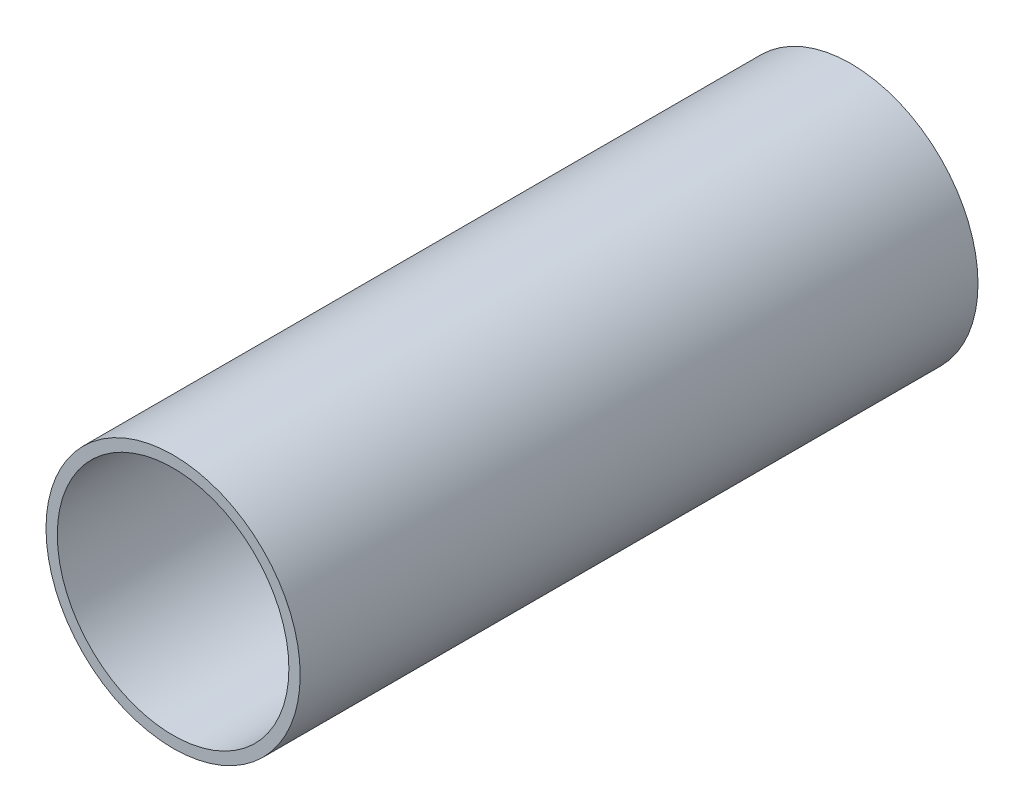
ISO-10303-21;
HEADER;
FILE_DESCRIPTION(('STEP AP214'),'2;1');
FILE_NAME('part.step','',(''),(''),'','','');
FILE_SCHEMA(('AUTOMOTIVE_DESIGN { 1 0 10303 214 1 1 1 1 }'));
ENDSEC;
DATA;
#1=APPLICATION_CONTEXT('core data for automotive mechanical design processes');
#2=APPLICATION_PROTOCOL_DEFINITION('international standard','automotive_design',2000,#1);
#3=PRODUCT_CONTEXT('',#1,'mechanical');
#4=PRODUCT('Part','Part','',(#3));
#5=PRODUCT_RELATED_PRODUCT_CATEGORY('part','',(#4));
#6=PRODUCT_DEFINITION_FORMATION('','',#4);
#7=PRODUCT_DEFINITION_CONTEXT('part definition',#1,'design');
#8=PRODUCT_DEFINITION('design','',#6,#7);
#9=PRODUCT_DEFINITION_SHAPE('','',#8);
#10=(LENGTH_UNIT() NAMED_UNIT(*) SI_UNIT(.MILLI.,.METRE.));
#11=(NAMED_UNIT(*) PLANE_ANGLE_UNIT() SI_UNIT($,.RADIAN.));
#12=(NAMED_UNIT(*) SI_UNIT($,.STERADIAN.) SOLID_ANGLE_UNIT());
#13=UNCERTAINTY_MEASURE_WITH_UNIT(LENGTH_MEASURE(1.E-05),#10,'distance_accuracy_value','');
#14=(GEOMETRIC_REPRESENTATION_CONTEXT(3) GLOBAL_UNCERTAINTY_ASSIGNED_CONTEXT((#13)) GLOBAL_UNIT_ASSIGNED_CONTEXT((#10,
#11,#12)) REPRESENTATION_CONTEXT('',''));
#15=CARTESIAN_POINT('',(0.,0.,0.));
#16=DIRECTION('',(0.,0.,1.));
#17=DIRECTION('',(1.,0.,0.));
#18=AXIS2_PLACEMENT_3D('',#15,#16,#17);
#19=CARTESIAN_POINT('',(0.,0.,120.));
#20=DIRECTION('',(0.,0.,1.));
#21=DIRECTION('',(1.,0.,0.));
#22=AXIS2_PLACEMENT_3D('',#19,#20,#21);
#23=PLANE('',#22);
#24=CARTESIAN_POINT('',(0.,0.,120.));
#25=DIRECTION('',(0.,0.,1.));
#26=DIRECTION('',(1.,0.,0.));
#27=AXIS2_PLACEMENT_3D('',#24,#25,#26);
#28=CIRCLE('',#27,22.5);
#29=CARTESIAN_POINT('',(22.5,0.,120.));
#30=VERTEX_POINT('',#29);
#31=EDGE_CURVE('E10',#30,#30,#28,.T.);
#32=ORIENTED_EDGE('',*,*,#31,.T.);
#33=EDGE_LOOP('',(#32));
#34=FACE_BOUND('',#33,.T.);
#35=CARTESIAN_POINT('',(0.,0.,120.));
#36=DIRECTION('',(0.,0.,1.));
#37=DIRECTION('',(1.,0.,0.));
#38=AXIS2_PLACEMENT_3D('',#35,#36,#37);
#39=CIRCLE('',#38,20.5);
#40=CARTESIAN_POINT('',(20.5,0.,120.));
#41=VERTEX_POINT('',#40);
#42=EDGE_CURVE('E40',#41,#41,#39,.T.);
#43=ORIENTED_EDGE('',*,*,#42,.F.);
#44=EDGE_LOOP('',(#43));
#45=FACE_BOUND('',#44,.T.);
#46=ADVANCED_FACE('F29',(#34,#45),#23,.T.);
#47=CARTESIAN_POINT('',(0.,0.,0.));
#48=DIRECTION('',(0.,0.,1.));
#49=DIRECTION('',(1.,0.,0.));
#50=AXIS2_PLACEMENT_3D('',#47,#48,#49);
#51=PLANE('',#50);
#52=CARTESIAN_POINT('',(0.,0.,0.));
#53=DIRECTION('',(0.,0.,1.));
#54=DIRECTION('',(1.,0.,0.));
#55=AXIS2_PLACEMENT_3D('',#52,#53,#54);
#56=CIRCLE('',#55,22.5);
#57=CARTESIAN_POINT('',(22.5,0.,0.));
#58=VERTEX_POINT('',#57);
#59=EDGE_CURVE('E33',#58,#58,#56,.T.);
#60=ORIENTED_EDGE('',*,*,#59,.F.);
#61=EDGE_LOOP('',(#60));
#62=FACE_BOUND('',#61,.T.);
#63=CARTESIAN_POINT('',(0.,0.,0.));
#64=DIRECTION('',(0.,0.,1.));
#65=DIRECTION('',(1.,0.,0.));
#66=AXIS2_PLACEMENT_3D('',#63,#64,#65);
#67=CIRCLE('',#66,20.5);
#68=CARTESIAN_POINT('',(20.5,0.,0.));
#69=VERTEX_POINT('',#68);
#70=EDGE_CURVE('E42',#69,#69,#67,.T.);
#71=ORIENTED_EDGE('',*,*,#70,.T.);
#72=EDGE_LOOP('',(#71));
#73=FACE_BOUND('',#72,.T.);
#74=ADVANCED_FACE('F52',(#62,#73),#51,.F.);
#75=CARTESIAN_POINT('',(0.,0.,120.));
#76=DIRECTION('',(0.,0.,-1.));
#77=DIRECTION('',(-1.,0.,0.));
#78=AXIS2_PLACEMENT_3D('',#75,#76,#77);
#79=CYLINDRICAL_SURFACE('',#78,22.5);
#80=ORIENTED_EDGE('',*,*,#31,.F.);
#81=EDGE_LOOP('',(#80));
#82=FACE_BOUND('',#81,.T.);
#83=ORIENTED_EDGE('',*,*,#59,.T.);
#84=EDGE_LOOP('',(#83));
#85=FACE_BOUND('',#84,.T.);
#86=ADVANCED_FACE('F31',(#82,#85),#79,.T.);
#87=CARTESIAN_POINT('',(0.,0.,120.));
#88=DIRECTION('',(0.,0.,-1.));
#89=DIRECTION('',(-1.,0.,0.));
#90=AXIS2_PLACEMENT_3D('',#87,#88,#89);
#91=CYLINDRICAL_SURFACE('',#90,20.5);
#92=ORIENTED_EDGE('',*,*,#42,.T.);
#93=EDGE_LOOP('',(#92));
#94=FACE_BOUND('',#93,.T.);
#95=ORIENTED_EDGE('',*,*,#70,.F.);
#96=EDGE_LOOP('',(#95));
#97=FACE_BOUND('',#96,.T.);
#98=ADVANCED_FACE('F48',(#94,#97),#91,.F.);
#99=CLOSED_SHELL('',(#46,#74,#86,#98));
#100=MANIFOLD_SOLID_BREP('B2',#99);
#101=ADVANCED_BREP_SHAPE_REPRESENTATION('',(#18,#100),#14);
#102=SHAPE_DEFINITION_REPRESENTATION(#9,#101);
ENDSEC;
END-ISO-10303-21;
